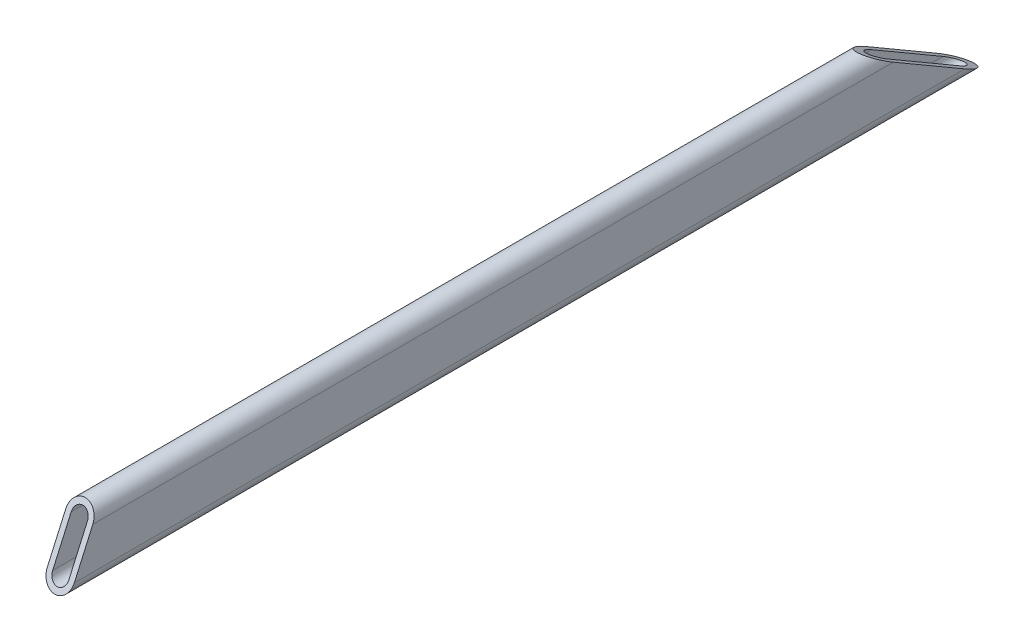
from build123d import *

# Parameters (mm, degrees)
EXTRUSION1_DEPTH = 255
EXTRUSION2_DEPTH = 7.5


with BuildPart() as part:
    # Esquisse1 → Extrusion1 (new, symmetric)
    with BuildSketch(Plane.XY):
        with BuildLine():
            Line((-7.5, 10.5), (-7.5, -12.5))
            ThreePointArc((-7.5, -12.5), (0, -20), (7.5, -12.5))
            Line((7.5, -12.5), (7.5, 10.5))
            ThreePointArc((7.5, 10.5), (0, 18), (-7.5, 10.5))
        make_face()
        with BuildLine():
            Line((4.5, 10.5), (4.5, -12.5))
            ThreePointArc((4.5, -12.5), (0, -17), (-4.5, -12.5))
            Line((-4.5, -12.5), (-4.5, 10.5))
            ThreePointArc((-4.5, 10.5), (0, 15), (4.5, 10.5))
        make_face(mode=Mode.SUBTRACT)
    extrude(amount=EXTRUSION1_DEPTH, both=True)

    # Esquisse2 → Extrusion2 (cut, symmetric)
    with BuildSketch(Plane(origin=(0, 0, 0), x_dir=(0, 0, -1), z_dir=(1, 0, 0))):
        Polygon((-255, -20), (-238.081309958, 18), (-255, 18), align=None)
        Polygon((255, -20), (189.709462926, 18), (255, 18), align=None)
    extrude(amount=EXTRUSION2_DEPTH, both=True, mode=Mode.SUBTRACT)


solid = part.part
